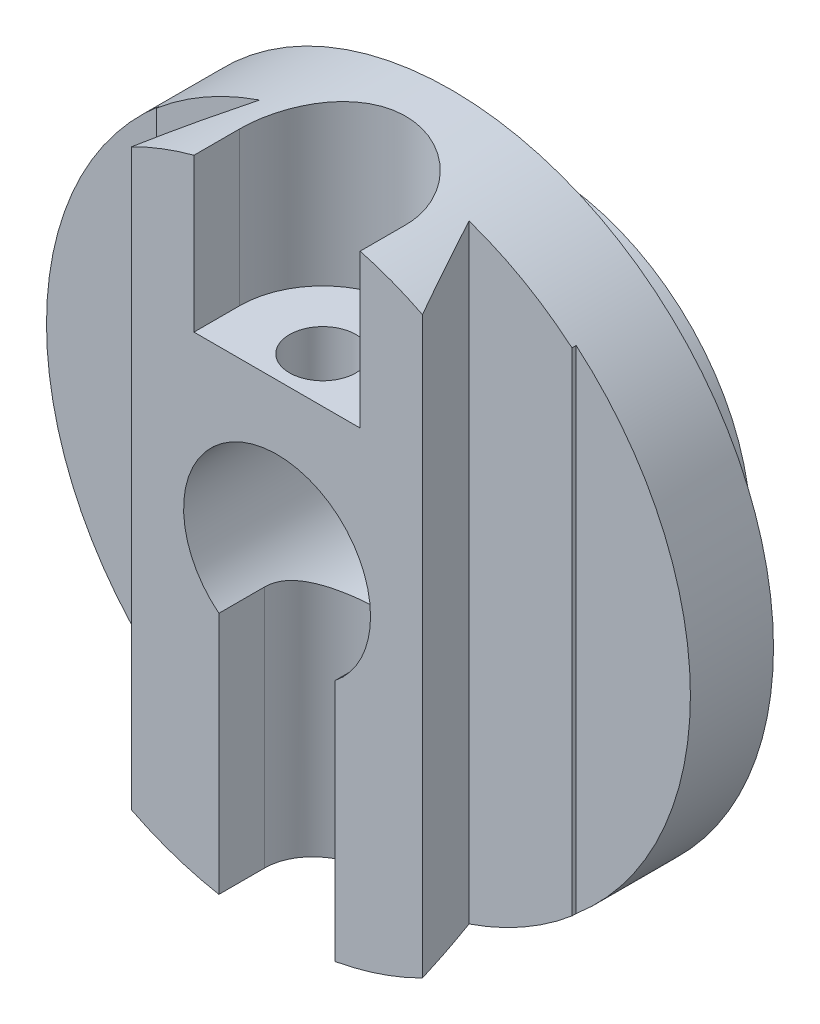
ISO-10303-21;
HEADER;
FILE_DESCRIPTION(('STEP AP214'),'2;1');
FILE_NAME('part.step','',(''),(''),'','','');
FILE_SCHEMA(('AUTOMOTIVE_DESIGN { 1 0 10303 214 1 1 1 1 }'));
ENDSEC;
DATA;
#1=APPLICATION_CONTEXT('core data for automotive mechanical design processes');
#2=APPLICATION_PROTOCOL_DEFINITION('international standard','automotive_design',2000,#1);
#3=PRODUCT_CONTEXT('',#1,'mechanical');
#4=PRODUCT('Part','Part','',(#3));
#5=PRODUCT_RELATED_PRODUCT_CATEGORY('part','',(#4));
#6=PRODUCT_DEFINITION_FORMATION('','',#4);
#7=PRODUCT_DEFINITION_CONTEXT('part definition',#1,'design');
#8=PRODUCT_DEFINITION('design','',#6,#7);
#9=PRODUCT_DEFINITION_SHAPE('','',#8);
#10=(LENGTH_UNIT() NAMED_UNIT(*) SI_UNIT(.MILLI.,.METRE.));
#11=(NAMED_UNIT(*) PLANE_ANGLE_UNIT() SI_UNIT($,.RADIAN.));
#12=(NAMED_UNIT(*) SI_UNIT($,.STERADIAN.) SOLID_ANGLE_UNIT());
#13=UNCERTAINTY_MEASURE_WITH_UNIT(LENGTH_MEASURE(1.E-05),#10,'distance_accuracy_value','');
#14=(GEOMETRIC_REPRESENTATION_CONTEXT(3) GLOBAL_UNCERTAINTY_ASSIGNED_CONTEXT((#13)) GLOBAL_UNIT_ASSIGNED_CONTEXT((#10,
#11,#12)) REPRESENTATION_CONTEXT('',''));
#15=CARTESIAN_POINT('',(0.,0.,0.));
#16=DIRECTION('',(0.,0.,1.));
#17=DIRECTION('',(1.,0.,0.));
#18=AXIS2_PLACEMENT_3D('',#15,#16,#17);
#19=CARTESIAN_POINT('',(0.,0.,64.));
#20=DIRECTION('',(0.,0.,-1.));
#21=DIRECTION('',(-1.,0.,0.));
#22=AXIS2_PLACEMENT_3D('',#19,#20,#21);
#23=CYLINDRICAL_SURFACE('',#22,77.5);
#24=CARTESIAN_POINT('',(0.,0.,22.));
#25=DIRECTION('',(0.,0.,1.));
#26=DIRECTION('',(1.,0.,0.));
#27=AXIS2_PLACEMENT_3D('',#24,#25,#26);
#28=CIRCLE('',#27,77.5);
#29=CARTESIAN_POINT('',(77.5,0.,22.));
#30=VERTEX_POINT('',#29);
#31=EDGE_CURVE('E232',#30,#30,#28,.T.);
#32=ORIENTED_EDGE('',*,*,#31,.T.);
#33=EDGE_LOOP('',(#32));
#34=FACE_BOUND('',#33,.T.);
#35=DIRECTION('',(0.,0.,-1.));
#36=VECTOR('',#35,1.);
#37=CARTESIAN_POINT('',(-14.,-76.2249959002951,64.));
#38=LINE('',#37,#36);
#39=CARTESIAN_POINT('',(-14.,-76.2249959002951,64.));
#40=VERTEX_POINT('',#39);
#41=CARTESIAN_POINT('',(-14.,-76.2249959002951,53.));
#42=VERTEX_POINT('',#41);
#43=EDGE_CURVE('E173',#40,#42,#38,.T.);
#44=ORIENTED_EDGE('',*,*,#43,.F.);
#45=CARTESIAN_POINT('',(0.,0.,64.));
#46=DIRECTION('',(0.,0.,1.));
#47=DIRECTION('',(1.,0.,0.));
#48=AXIS2_PLACEMENT_3D('',#45,#46,#47);
#49=CIRCLE('',#48,77.5);
#50=CARTESIAN_POINT('',(-35.,-69.1465834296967,64.));
#51=VERTEX_POINT('',#50);
#52=EDGE_CURVE('E226',#51,#40,#49,.T.);
#53=ORIENTED_EDGE('',*,*,#52,.F.);
#54=CARTESIAN_POINT('',(0.,0.,-11.057742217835));
#55=DIRECTION('',(0.906307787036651,0.,0.422618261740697));
#56=DIRECTION('',(0.422618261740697,0.,-0.906307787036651));
#57=AXIS2_PLACEMENT_3D('',#54,#55,#56);
#58=ELLIPSE('',#57,183.38062269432,77.5);
#59=CARTESIAN_POINT('',(-25.2075391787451,-73.2859465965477,43.));
#60=VERTEX_POINT('',#59);
#61=EDGE_CURVE('E222',#51,#60,#58,.T.);
#62=ORIENTED_EDGE('',*,*,#61,.T.);
#63=CARTESIAN_POINT('',(0.,0.,43.));
#64=DIRECTION('',(0.,0.,-1.));
#65=DIRECTION('',(-1.,0.,0.));
#66=AXIS2_PLACEMENT_3D('',#63,#64,#65);
#67=CIRCLE('',#66,77.5);
#68=CARTESIAN_POINT('',(-50.,-59.2135964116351,43.));
#69=VERTEX_POINT('',#68);
#70=EDGE_CURVE('E250',#60,#69,#67,.T.);
#71=ORIENTED_EDGE('',*,*,#70,.T.);
#72=DIRECTION('',(0.,0.,-1.));
#73=VECTOR('',#72,1.);
#74=CARTESIAN_POINT('',(-50.,-59.2135964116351,64.));
#75=LINE('',#74,#73);
#76=CARTESIAN_POINT('',(-50.,-59.2135964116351,42.));
#77=VERTEX_POINT('',#76);
#78=EDGE_CURVE('E253',#69,#77,#75,.T.);
#79=ORIENTED_EDGE('',*,*,#78,.T.);
#80=CARTESIAN_POINT('',(0.,0.,42.));
#81=DIRECTION('',(0.,0.,-1.));
#82=DIRECTION('',(-1.,0.,0.));
#83=AXIS2_PLACEMENT_3D('',#80,#81,#82);
#84=CIRCLE('',#83,77.5);
#85=CARTESIAN_POINT('',(-50.,59.2135964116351,42.));
#86=VERTEX_POINT('',#85);
#87=EDGE_CURVE('E257',#77,#86,#84,.T.);
#88=ORIENTED_EDGE('',*,*,#87,.T.);
#89=DIRECTION('',(0.,0.,-1.));
#90=VECTOR('',#89,1.);
#91=CARTESIAN_POINT('',(-50.,59.2135964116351,64.));
#92=LINE('',#91,#90);
#93=CARTESIAN_POINT('',(-50.,59.2135964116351,43.));
#94=VERTEX_POINT('',#93);
#95=EDGE_CURVE('E259',#86,#94,#92,.F.);
#96=ORIENTED_EDGE('',*,*,#95,.T.);
#97=CARTESIAN_POINT('',(-25.2075391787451,73.2859465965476,43.));
#98=VERTEX_POINT('',#97);
#99=EDGE_CURVE('E254',#94,#98,#67,.T.);
#100=ORIENTED_EDGE('',*,*,#99,.T.);
#101=CARTESIAN_POINT('',(-35.,69.1465834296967,64.));
#102=VERTEX_POINT('',#101);
#103=EDGE_CURVE('E225',#98,#102,#58,.T.);
#104=ORIENTED_EDGE('',*,*,#103,.T.);
#105=CARTESIAN_POINT('',(-20.,74.8748956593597,64.));
#106=VERTEX_POINT('',#105);
#107=EDGE_CURVE('E229',#106,#102,#49,.T.);
#108=ORIENTED_EDGE('',*,*,#107,.F.);
#109=DIRECTION('',(0.,0.,-1.));
#110=VECTOR('',#109,1.);
#111=CARTESIAN_POINT('',(-20.,74.8748956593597,64.));
#112=LINE('',#111,#110);
#113=CARTESIAN_POINT('',(-20.,74.8748956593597,53.));
#114=VERTEX_POINT('',#113);
#115=EDGE_CURVE('E183',#106,#114,#112,.T.);
#116=ORIENTED_EDGE('',*,*,#115,.T.);
#117=CARTESIAN_POINT('',(-20.,74.8748956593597,53.));
#118=CARTESIAN_POINT('',(-20.0000009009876,74.8748931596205,52.7237468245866));
#119=CARTESIAN_POINT('',(-19.9942755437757,74.8764250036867,52.4475255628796));
#120=CARTESIAN_POINT('',(-19.971394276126,74.8825321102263,51.8955991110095));
#121=CARTESIAN_POINT('',(-19.954238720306,74.8871072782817,51.6198939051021));
#122=CARTESIAN_POINT('',(-19.8856770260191,74.905355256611,50.7944200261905));
#123=CARTESIAN_POINT('',(-19.8171758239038,74.9235505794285,50.2460765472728));
#124=CARTESIAN_POINT('',(-19.6353414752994,74.9714089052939,49.1585553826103));
#125=CARTESIAN_POINT('',(-19.5221008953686,75.0010482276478,48.6193611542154));
#126=CARTESIAN_POINT('',(-19.3193923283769,75.0534200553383,47.8195767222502));
#127=CARTESIAN_POINT('',(-19.2463430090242,75.0721974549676,47.5544679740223));
#128=CARTESIAN_POINT('',(-19.0894196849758,75.1122534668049,47.027594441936));
#129=CARTESIAN_POINT('',(-19.0055430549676,75.1335326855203,46.7658304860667));
#130=CARTESIAN_POINT('',(-18.7379988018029,75.2008732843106,45.9865177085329));
#131=CARTESIAN_POINT('',(-18.5383456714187,75.2504562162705,45.4746676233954));
#132=CARTESIAN_POINT('',(-18.0979783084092,75.3575773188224,44.4698110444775));
#133=CARTESIAN_POINT('',(-17.8572630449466,75.4151156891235,43.9768050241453));
#134=CARTESIAN_POINT('',(-17.4667420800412,75.506163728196,43.2538188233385));
#135=CARTESIAN_POINT('',(-17.3316160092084,75.5373130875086,43.0155090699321));
#136=CARTESIAN_POINT('',(-17.0518157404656,75.60096671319,42.5448328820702));
#137=CARTESIAN_POINT('',(-16.9071439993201,75.6334706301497,42.3124649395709));
#138=CARTESIAN_POINT('',(-16.4590905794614,75.7327006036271,41.6246898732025));
#139=CARTESIAN_POINT('',(-16.14165249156,75.8011491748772,41.1785778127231));
#140=CARTESIAN_POINT('',(-15.4645151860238,75.9422204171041,40.3050949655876));
#141=CARTESIAN_POINT('',(-15.1040682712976,76.014900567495,39.8783147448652));
#142=CARTESIAN_POINT('',(-14.3488180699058,76.1610748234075,39.0564402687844));
#143=CARTESIAN_POINT('',(-13.9540142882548,76.2345689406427,38.6613464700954));
#144=CARTESIAN_POINT('',(-13.1325709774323,76.3803611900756,37.9053917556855));
#145=CARTESIAN_POINT('',(-12.7059264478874,76.452659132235,37.5445362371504));
#146=CARTESIAN_POINT('',(-11.8236088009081,76.5940719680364,36.8595478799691));
#147=CARTESIAN_POINT('',(-11.3679355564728,76.6631868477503,36.5354152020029));
#148=CARTESIAN_POINT('',(-10.4234962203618,76.7973408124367,35.921574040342));
#149=CARTESIAN_POINT('',(-9.93433692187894,76.8623034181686,35.6324533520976));
#150=CARTESIAN_POINT('',(-8.93248470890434,76.9851633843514,35.0965523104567));
#151=CARTESIAN_POINT('',(-8.419791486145,77.0430606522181,34.8497725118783));
#152=CARTESIAN_POINT('',(-7.37454957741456,77.1501259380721,34.4005500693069));
#153=CARTESIAN_POINT('',(-6.84200428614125,77.1992954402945,34.198099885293));
#154=CARTESIAN_POINT('',(-5.76082393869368,77.2874959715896,33.8391720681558));
#155=CARTESIAN_POINT('',(-5.21218928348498,77.32652725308,33.6826932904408));
#156=CARTESIAN_POINT('',(-4.11484145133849,77.3925945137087,33.4199205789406));
#157=CARTESIAN_POINT('',(-3.56638376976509,77.4198704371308,33.3126196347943));
#158=CARTESIAN_POINT('',(-2.46196707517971,77.4628561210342,33.1442521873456));
#159=CARTESIAN_POINT('',(-1.90600815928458,77.4785660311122,33.0831850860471));
#160=CARTESIAN_POINT('',(-0.790783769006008,77.4979719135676,33.0078270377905));
#161=CARTESIAN_POINT('',(-0.231518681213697,77.5016692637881,32.9935307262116));
#162=CARTESIAN_POINT('',(0.886188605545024,77.4969481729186,33.0118270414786));
#163=CARTESIAN_POINT('',(1.44463081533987,77.4885298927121,33.0444190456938));
#164=CARTESIAN_POINT('',(2.54334334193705,77.4601591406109,33.1548744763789));
#165=CARTESIAN_POINT('',(3.08373085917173,77.4404844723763,33.2316477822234));
#166=CARTESIAN_POINT('',(4.15593270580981,77.3903498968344,33.4289664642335));
#167=CARTESIAN_POINT('',(4.68774719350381,77.3598901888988,33.5495110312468));
#168=CARTESIAN_POINT('',(5.73915279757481,77.2890016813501,33.8333974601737));
#169=CARTESIAN_POINT('',(6.25874361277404,77.2485726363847,33.9967403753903));
#170=CARTESIAN_POINT('',(7.28220520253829,77.1588193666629,34.3649453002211));
#171=CARTESIAN_POINT('',(7.78607574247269,77.1094950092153,34.5698079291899));
#172=CARTESIAN_POINT('',(8.77948961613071,77.0027435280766,35.0216481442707));
#173=CARTESIAN_POINT('',(9.26885208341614,76.9452440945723,35.2690061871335));
#174=CARTESIAN_POINT('',(10.2250429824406,76.8240247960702,35.8026664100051));
#175=CARTESIAN_POINT('',(10.6918713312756,76.7603049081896,36.0889687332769));
#176=CARTESIAN_POINT('',(11.6001141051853,76.6283106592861,36.698572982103));
#177=CARTESIAN_POINT('',(12.0415251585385,76.5600356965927,37.0218797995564));
#178=CARTESIAN_POINT('',(12.8961303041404,76.4207256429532,37.7033166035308));
#179=CARTESIAN_POINT('',(13.3093238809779,76.3496905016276,38.0614472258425));
#180=CARTESIAN_POINT('',(14.1163696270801,76.2046652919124,38.821005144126));
#181=CARTESIAN_POINT('',(14.5093255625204,76.1306489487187,39.2233804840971));
#182=CARTESIAN_POINT('',(15.2600590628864,75.9837282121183,40.0598880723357));
#183=CARTESIAN_POINT('',(15.6178357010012,75.9108238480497,40.4940211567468));
#184=CARTESIAN_POINT('',(16.2959182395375,75.7681539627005,41.3914125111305));
#185=CARTESIAN_POINT('',(16.6162131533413,75.6983893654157,41.8546792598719));
#186=CARTESIAN_POINT('',(17.0666380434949,75.5976423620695,42.5688378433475));
#187=CARTESIAN_POINT('',(17.2117803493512,75.5647091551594,42.8101073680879));
#188=CARTESIAN_POINT('',(17.4918740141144,75.500364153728,43.2987796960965));
#189=CARTESIAN_POINT('',(17.626822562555,75.4689527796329,43.5461841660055));
#190=CARTESIAN_POINT('',(18.0174429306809,75.3770103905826,44.2998214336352));
#191=CARTESIAN_POINT('',(18.2571733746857,75.3191589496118,44.8147589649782));
#192=CARTESIAN_POINT('',(18.6922268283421,75.2123720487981,45.8639543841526));
#193=CARTESIAN_POINT('',(18.8875511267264,75.1634363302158,46.3982117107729));
#194=CARTESIAN_POINT('',(19.1459044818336,75.0978837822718,47.2107789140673));
#195=CARTESIAN_POINT('',(19.2262228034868,75.0773486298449,47.483377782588));
#196=CARTESIAN_POINT('',(19.375198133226,75.0390405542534,48.0318569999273));
#197=CARTESIAN_POINT('',(19.4438580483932,75.0212669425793,48.3077365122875));
#198=CARTESIAN_POINT('',(19.632090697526,74.9723149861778,49.1394443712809));
#199=CARTESIAN_POINT('',(19.7340166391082,74.9454798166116,49.699657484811));
#200=CARTESIAN_POINT('',(19.8745195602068,74.9083291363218,50.7167776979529));
#201=CARTESIAN_POINT('',(19.9215862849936,74.8958095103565,51.1724663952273));
#202=CARTESIAN_POINT('',(19.9843128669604,74.8790856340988,52.0854153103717));
#203=CARTESIAN_POINT('',(20.0000230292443,74.8748680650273,52.5426718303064));
#204=CARTESIAN_POINT('',(20.,74.8748956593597,53.));
#205=B_SPLINE_CURVE_WITH_KNOTS('',3,(#117,#118,#119,#120,#121,#122,#123,#124,#125,#126,#127,
#128,#129,#130,#131,#132,#133,#134,#135,#136,#137,#138,#139,#140,#141,#142,#143,#144,#145,#146,
#147,#148,#149,#150,#151,#152,#153,#154,#155,#156,#157,#158,#159,#160,#161,#162,#163,#164,#165,
#166,#167,#168,#169,#170,#171,#172,#173,#174,#175,#176,#177,#178,#179,#180,#181,#182,#183,#184,
#185,#186,#187,#188,#189,#190,#191,#192,#193,#194,#195,#196,#197,#198,#199,#200,#201,#202,#203,
#204),.UNSPECIFIED.,.F.,.F.,(4,2,2,2,2,2,2,2,2,2,2,2,2,2,2,2,2,2,2,2,2,2,2,2,2,2,2,2,2,2,2,2,2,
2,2,2,2,2,2,2,2,2,2,4),(0.,0.828632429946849,1.65723915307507,3.31380514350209,4.96696146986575,
5.79363536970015,6.62051009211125,8.27339282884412,9.9263170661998,10.7532693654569,
11.5800096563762,13.2333749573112,14.9214725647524,16.6095944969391,18.2979820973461,
19.9863770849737,21.7000407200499,23.4137268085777,25.1271211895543,26.8404729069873,
28.5169730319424,30.1934514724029,31.8697376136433,33.5460014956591,35.1825779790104,
36.8191242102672,38.4557107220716,40.0923216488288,41.7444312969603,43.3965470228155,
45.0488814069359,46.7012459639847,48.4010637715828,50.1009263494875,51.8012859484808,
52.65151265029,53.5019729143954,55.2125774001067,56.9231322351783,57.7776702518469,
58.6319948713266,60.3396514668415,61.7134133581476,63.0849695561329),.UNSPECIFIED.);
#206=CARTESIAN_POINT('',(20.,74.8748956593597,53.));
#207=VERTEX_POINT('',#206);
#208=EDGE_CURVE('E167',#114,#207,#205,.T.);
#209=ORIENTED_EDGE('',*,*,#208,.T.);
#210=DIRECTION('',(0.,0.,-1.));
#211=VECTOR('',#210,1.);
#212=CARTESIAN_POINT('',(20.,74.8748956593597,64.));
#213=LINE('',#212,#211);
#214=CARTESIAN_POINT('',(20.,74.8748956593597,64.));
#215=VERTEX_POINT('',#214);
#216=EDGE_CURVE('E189',#207,#215,#213,.F.);
#217=ORIENTED_EDGE('',*,*,#216,.T.);
#218=CARTESIAN_POINT('',(35.,69.1465834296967,64.));
#219=VERTEX_POINT('',#218);
#220=EDGE_CURVE('E231',#219,#215,#49,.T.);
#221=ORIENTED_EDGE('',*,*,#220,.F.);
#222=CARTESIAN_POINT('',(0.,0.,-11.057742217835));
#223=DIRECTION('',(0.906307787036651,0.,-0.422618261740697));
#224=DIRECTION('',(-0.422618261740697,0.,-0.906307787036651));
#225=AXIS2_PLACEMENT_3D('',#222,#223,#224);
#226=ELLIPSE('',#225,183.38062269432,77.5);
#227=CARTESIAN_POINT('',(25.2075391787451,73.2859465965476,43.));
#228=VERTEX_POINT('',#227);
#229=EDGE_CURVE('E221',#228,#219,#226,.T.);
#230=ORIENTED_EDGE('',*,*,#229,.F.);
#231=CARTESIAN_POINT('',(0.,0.,43.));
#232=DIRECTION('',(0.,0.,1.));
#233=DIRECTION('',(1.,0.,0.));
#234=AXIS2_PLACEMENT_3D('',#231,#232,#233);
#235=CIRCLE('',#234,77.5);
#236=CARTESIAN_POINT('',(50.,59.2135964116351,43.));
#237=VERTEX_POINT('',#236);
#238=EDGE_CURVE('E249',#237,#228,#235,.T.);
#239=ORIENTED_EDGE('',*,*,#238,.F.);
#240=DIRECTION('',(0.,0.,-1.));
#241=VECTOR('',#240,1.);
#242=CARTESIAN_POINT('',(50.,59.2135964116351,64.));
#243=LINE('',#242,#241);
#244=CARTESIAN_POINT('',(50.,59.2135964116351,42.));
#245=VERTEX_POINT('',#244);
#246=EDGE_CURVE('E243',#245,#237,#243,.F.);
#247=ORIENTED_EDGE('',*,*,#246,.F.);
#248=CARTESIAN_POINT('',(0.,0.,42.));
#249=DIRECTION('',(0.,0.,1.));
#250=DIRECTION('',(1.,0.,0.));
#251=AXIS2_PLACEMENT_3D('',#248,#249,#250);
#252=CIRCLE('',#251,77.5);
#253=CARTESIAN_POINT('',(50.,-59.2135964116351,42.));
#254=VERTEX_POINT('',#253);
#255=EDGE_CURVE('E241',#254,#245,#252,.T.);
#256=ORIENTED_EDGE('',*,*,#255,.F.);
#257=DIRECTION('',(0.,0.,-1.));
#258=VECTOR('',#257,1.);
#259=CARTESIAN_POINT('',(50.,-59.2135964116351,64.));
#260=LINE('',#259,#258);
#261=CARTESIAN_POINT('',(50.,-59.2135964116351,43.));
#262=VERTEX_POINT('',#261);
#263=EDGE_CURVE('E245',#262,#254,#260,.T.);
#264=ORIENTED_EDGE('',*,*,#263,.F.);
#265=CARTESIAN_POINT('',(25.2075391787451,-73.2859465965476,43.));
#266=VERTEX_POINT('',#265);
#267=EDGE_CURVE('E247',#266,#262,#235,.T.);
#268=ORIENTED_EDGE('',*,*,#267,.F.);
#269=CARTESIAN_POINT('',(35.,-69.1465834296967,64.));
#270=VERTEX_POINT('',#269);
#271=EDGE_CURVE('E205',#270,#266,#226,.T.);
#272=ORIENTED_EDGE('',*,*,#271,.F.);
#273=CARTESIAN_POINT('',(14.,-76.2249959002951,64.));
#274=VERTEX_POINT('',#273);
#275=EDGE_CURVE('E230',#274,#270,#49,.T.);
#276=ORIENTED_EDGE('',*,*,#275,.F.);
#277=DIRECTION('',(0.,0.,-1.));
#278=VECTOR('',#277,1.);
#279=CARTESIAN_POINT('',(14.,-76.2249959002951,64.));
#280=LINE('',#279,#278);
#281=CARTESIAN_POINT('',(14.,-76.2249959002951,53.));
#282=VERTEX_POINT('',#281);
#283=EDGE_CURVE('E322',#282,#274,#280,.F.);
#284=ORIENTED_EDGE('',*,*,#283,.F.);
#285=CARTESIAN_POINT('',(-14.,-76.2249959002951,53.));
#286=CARTESIAN_POINT('',(-14.000045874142,-76.2249646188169,52.6096710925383));
#287=CARTESIAN_POINT('',(-13.9836780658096,-76.2279930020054,52.2193531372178));
#288=CARTESIAN_POINT('',(-13.9184497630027,-76.2399421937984,51.4415738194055));
#289=CARTESIAN_POINT('',(-13.8695928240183,-76.2488623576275,51.0541121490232));
#290=CARTESIAN_POINT('',(-13.7398097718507,-76.2723521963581,50.2853204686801));
#291=CARTESIAN_POINT('',(-13.6589276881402,-76.2869141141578,49.9039827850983));
#292=CARTESIAN_POINT('',(-13.4657335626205,-76.3212532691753,49.1495971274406));
#293=CARTESIAN_POINT('',(-13.3534214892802,-76.3410305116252,48.7765491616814));
#294=CARTESIAN_POINT('',(-13.0981949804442,-76.3852343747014,48.0412949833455));
#295=CARTESIAN_POINT('',(-12.9552757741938,-76.4096617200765,47.6790904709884));
#296=CARTESIAN_POINT('',(-12.6399020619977,-76.4624641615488,46.9680741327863));
#297=CARTESIAN_POINT('',(-12.4674471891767,-76.4908393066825,46.6192624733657));
#298=CARTESIAN_POINT('',(-12.094240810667,-76.5507350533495,45.9373940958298));
#299=CARTESIAN_POINT('',(-11.8934885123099,-76.5822557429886,45.604337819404));
#300=CARTESIAN_POINT('',(-11.4651019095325,-76.6475594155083,44.9562239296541));
#301=CARTESIAN_POINT('',(-11.2374674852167,-76.6813424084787,44.6411663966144));
#302=CARTESIAN_POINT('',(-10.754416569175,-76.7505872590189,44.0280214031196));
#303=CARTESIAN_POINT('',(-10.4987393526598,-76.786062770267,43.7301408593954));
#304=CARTESIAN_POINT('',(-9.96330605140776,-76.8573708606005,43.1569133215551));
#305=CARTESIAN_POINT('',(-9.68354977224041,-76.8932034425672,42.8815665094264));
#306=CARTESIAN_POINT('',(-9.10182172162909,-76.9642299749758,42.3552492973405));
#307=CARTESIAN_POINT('',(-8.79984657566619,-76.9994238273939,42.1042826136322));
#308=CARTESIAN_POINT('',(-8.17576974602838,-77.0681861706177,41.6285116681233));
#309=CARTESIAN_POINT('',(-7.85366803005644,-77.1017546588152,41.4037074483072));
#310=CARTESIAN_POINT('',(-7.18919345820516,-77.1665581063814,40.9803588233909));
#311=CARTESIAN_POINT('',(-6.84669362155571,-77.1977749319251,40.782010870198));
#312=CARTESIAN_POINT('',(-6.14589181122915,-77.256725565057,40.4149102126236));
#313=CARTESIAN_POINT('',(-5.7875897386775,-77.2844593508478,40.2461576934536));
#314=CARTESIAN_POINT('',(-5.05775660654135,-77.3356507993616,39.9395349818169));
#315=CARTESIAN_POINT('',(-4.68622707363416,-77.3591089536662,39.801661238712));
#316=CARTESIAN_POINT('',(-3.93256507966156,-77.4010810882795,39.5578353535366));
#317=CARTESIAN_POINT('',(-3.550432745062,-77.4195951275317,39.4518828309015));
#318=CARTESIAN_POINT('',(-2.78251054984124,-77.4509761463,39.2736997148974));
#319=CARTESIAN_POINT('',(-2.39680463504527,-77.4639018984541,39.2011176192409));
#320=CARTESIAN_POINT('',(-1.62051425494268,-77.4840285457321,39.0885747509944));
#321=CARTESIAN_POINT('',(-1.22992982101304,-77.4912294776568,39.0486137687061));
#322=CARTESIAN_POINT('',(-0.446738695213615,-77.4997018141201,39.0016316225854));
#323=CARTESIAN_POINT('',(-0.0541320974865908,-77.500973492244,38.9946089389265));
#324=CARTESIAN_POINT('',(0.730256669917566,-77.4975518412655,39.0135555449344));
#325=CARTESIAN_POINT('',(1.12203884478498,-77.4928585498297,39.0395246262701));
#326=CARTESIAN_POINT('',(1.89737648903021,-77.4777294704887,39.1237522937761));
#327=CARTESIAN_POINT('',(2.2809746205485,-77.4673612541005,39.1816309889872));
#328=CARTESIAN_POINT('',(3.04186597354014,-77.4412161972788,39.3289643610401));
#329=CARTESIAN_POINT('',(3.41915925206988,-77.4254394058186,39.4184187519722));
#330=CARTESIAN_POINT('',(4.16481126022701,-77.3889119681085,39.6282254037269));
#331=CARTESIAN_POINT('',(4.53316984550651,-77.3681612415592,39.7485781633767));
#332=CARTESIAN_POINT('',(5.25840864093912,-77.3222553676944,40.019285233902));
#333=CARTESIAN_POINT('',(5.61528875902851,-77.2971001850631,40.1696397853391));
#334=CARTESIAN_POINT('',(6.31699775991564,-77.2429287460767,40.500130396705));
#335=CARTESIAN_POINT('',(6.66175282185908,-77.213892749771,40.6804199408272));
#336=CARTESIAN_POINT('',(7.33487492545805,-77.1528601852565,41.0689220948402));
#337=CARTESIAN_POINT('',(7.66324192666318,-77.1208636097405,41.2771347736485));
#338=CARTESIAN_POINT('',(8.30140321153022,-77.0547833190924,41.7200370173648));
#339=CARTESIAN_POINT('',(8.61119665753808,-77.0206995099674,41.9547277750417));
#340=CARTESIAN_POINT('',(9.21013354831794,-76.9513764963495,42.4489718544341));
#341=CARTESIAN_POINT('',(9.49927682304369,-76.9161372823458,42.7085253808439));
#342=CARTESIAN_POINT('',(10.0589170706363,-76.8449666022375,43.2545816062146));
#343=CARTESIAN_POINT('',(10.3290927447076,-76.8090323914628,43.5414133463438));
#344=CARTESIAN_POINT('',(10.8443634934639,-76.737979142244,44.1368850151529));
#345=CARTESIAN_POINT('',(11.0894581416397,-76.7028601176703,44.445525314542));
#346=CARTESIAN_POINT('',(11.552917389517,-76.6344244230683,45.0825946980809));
#347=CARTESIAN_POINT('',(11.7712740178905,-76.6011082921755,45.4110296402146));
#348=CARTESIAN_POINT('',(12.1796054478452,-76.5372454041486,46.0853372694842));
#349=CARTESIAN_POINT('',(12.3695811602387,-76.5066985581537,46.4312093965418));
#350=CARTESIAN_POINT('',(12.7201354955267,-76.4491974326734,47.1387415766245));
#351=CARTESIAN_POINT('',(12.8806517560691,-76.4222508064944,47.500433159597));
#352=CARTESIAN_POINT('',(13.1705816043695,-76.3728186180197,48.2363684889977));
#353=CARTESIAN_POINT('',(13.2999957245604,-76.3503329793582,48.6106120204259));
#354=CARTESIAN_POINT('',(13.526581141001,-76.3105158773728,49.3684919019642));
#355=CARTESIAN_POINT('',(13.623792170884,-76.2931780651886,49.7521160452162));
#356=CARTESIAN_POINT('',(13.7853872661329,-76.2641452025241,50.5262685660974));
#357=CARTESIAN_POINT('',(13.849787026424,-76.2524474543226,50.9167935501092));
#358=CARTESIAN_POINT('',(13.9316803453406,-76.2375202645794,51.5899600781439));
#359=CARTESIAN_POINT('',(13.957313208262,-76.2328271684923,51.8716065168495));
#360=CARTESIAN_POINT('',(13.9914629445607,-76.2265638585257,52.4354931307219));
#361=CARTESIAN_POINT('',(14.0000085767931,-76.2249883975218,52.7177315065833));
#362=CARTESIAN_POINT('',(14.,-76.2249959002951,53.));
#363=B_SPLINE_CURVE_WITH_KNOTS('',3,(#285,#286,#287,#288,#289,#290,#291,#292,#293,#294,#295,
#296,#297,#298,#299,#300,#301,#302,#303,#304,#305,#306,#307,#308,#309,#310,#311,#312,#313,#314,
#315,#316,#317,#318,#319,#320,#321,#322,#323,#324,#325,#326,#327,#328,#329,#330,#331,#332,#333,
#334,#335,#336,#337,#338,#339,#340,#341,#342,#343,#344,#345,#346,#347,#348,#349,#350,#351,#352,
#353,#354,#355,#356,#357,#358,#359,#360,#361,#362),.UNSPECIFIED.,.F.,.F.,(4,2,2,2,2,2,2,2,2,2,2,
2,2,2,2,2,2,2,2,2,2,2,2,2,2,2,2,2,2,2,2,2,2,2,2,2,2,2,4),(0.,1.17061558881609,2.34110309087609,
3.50998691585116,4.67887191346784,5.84793923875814,7.0170210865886,8.18613568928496,
9.35525550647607,10.5363524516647,11.7174589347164,12.8987451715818,14.0800333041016,
15.2696554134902,16.4592849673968,17.6487776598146,18.8382561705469,20.0149010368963,
21.1915383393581,22.3681213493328,23.5446969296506,24.7075584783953,25.8704094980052,
27.0332792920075,28.1961584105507,29.3651952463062,30.534234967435,31.7033273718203,
32.8724294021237,34.0580550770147,35.2437009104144,36.4296993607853,37.6156597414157,
38.8041024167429,39.9925247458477,41.1794752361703,42.3658574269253,43.2138985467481,
44.0605111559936),.UNSPECIFIED.);
#364=EDGE_CURVE('E316',#42,#282,#363,.T.);
#365=ORIENTED_EDGE('',*,*,#364,.F.);
#366=EDGE_LOOP('',(#44,#53,#62,#71,#79,#88,#96,#100,#104,#108,#116,#209,#217,#221,#230,#239,
#247,#256,#264,#268,#272,#276,#284,#365));
#367=FACE_BOUND('',#366,.T.);
#368=ADVANCED_FACE('F45',(#34,#367),#23,.T.);
#369=CARTESIAN_POINT('',(0.,0.,64.));
#370=DIRECTION('',(0.,0.,1.));
#371=DIRECTION('',(1.,0.,0.));
#372=AXIS2_PLACEMENT_3D('',#369,#370,#371);
#373=PLANE('',#372);
#374=ORIENTED_EDGE('',*,*,#52,.T.);
#375=DIRECTION('',(0.,-1.,0.));
#376=VECTOR('',#375,1.);
#377=CARTESIAN_POINT('',(-14.,0.,64.));
#378=LINE('',#377,#376);
#379=CARTESIAN_POINT('',(-14.,-17.6139149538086,64.));
#380=VERTEX_POINT('',#379);
#381=EDGE_CURVE('E323',#380,#40,#378,.T.);
#382=ORIENTED_EDGE('',*,*,#381,.F.);
#383=CARTESIAN_POINT('',(0.,0.,64.));
#384=DIRECTION('',(0.,0.,1.));
#385=DIRECTION('',(1.,0.,0.));
#386=AXIS2_PLACEMENT_3D('',#383,#384,#385);
#387=CIRCLE('',#386,22.5);
#388=CARTESIAN_POINT('',(14.,-17.6139149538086,64.));
#389=VERTEX_POINT('',#388);
#390=EDGE_CURVE('E179',#389,#380,#387,.T.);
#391=ORIENTED_EDGE('',*,*,#390,.F.);
#392=DIRECTION('',(0.,-1.,0.));
#393=VECTOR('',#392,1.);
#394=CARTESIAN_POINT('',(14.,0.,64.));
#395=LINE('',#394,#393);
#396=EDGE_CURVE('E365',#389,#274,#395,.T.);
#397=ORIENTED_EDGE('',*,*,#396,.T.);
#398=ORIENTED_EDGE('',*,*,#275,.T.);
#399=DIRECTION('',(0.,1.,0.));
#400=VECTOR('',#399,1.);
#401=CARTESIAN_POINT('',(35.,0.,64.));
#402=LINE('',#401,#400);
#403=EDGE_CURVE('E235',#270,#219,#402,.T.);
#404=ORIENTED_EDGE('',*,*,#403,.T.);
#405=ORIENTED_EDGE('',*,*,#220,.T.);
#406=DIRECTION('',(0.,1.,0.));
#407=VECTOR('',#406,1.);
#408=CARTESIAN_POINT('',(20.,38.,64.));
#409=LINE('',#408,#407);
#410=CARTESIAN_POINT('',(20.,38.,64.));
#411=VERTEX_POINT('',#410);
#412=EDGE_CURVE('E342',#411,#215,#409,.T.);
#413=ORIENTED_EDGE('',*,*,#412,.F.);
#414=DIRECTION('',(1.,0.,0.));
#415=VECTOR('',#414,1.);
#416=CARTESIAN_POINT('',(-20.,38.,64.));
#417=LINE('',#416,#415);
#418=CARTESIAN_POINT('',(-20.,38.,64.));
#419=VERTEX_POINT('',#418);
#420=EDGE_CURVE('E328',#419,#411,#417,.T.);
#421=ORIENTED_EDGE('',*,*,#420,.F.);
#422=DIRECTION('',(0.,1.,0.));
#423=VECTOR('',#422,1.);
#424=CARTESIAN_POINT('',(-20.,38.,64.));
#425=LINE('',#424,#423);
#426=EDGE_CURVE('E335',#419,#106,#425,.T.);
#427=ORIENTED_EDGE('',*,*,#426,.T.);
#428=ORIENTED_EDGE('',*,*,#107,.T.);
#429=DIRECTION('',(0.,1.,0.));
#430=VECTOR('',#429,1.);
#431=CARTESIAN_POINT('',(-35.,0.,64.));
#432=LINE('',#431,#430);
#433=EDGE_CURVE('E238',#51,#102,#432,.T.);
#434=ORIENTED_EDGE('',*,*,#433,.F.);
#435=EDGE_LOOP('',(#374,#382,#391,#397,#398,#404,#405,#413,#421,#427,#428,#434));
#436=FACE_BOUND('',#435,.T.);
#437=ADVANCED_FACE('F296',(#436),#373,.T.);
#438=CARTESIAN_POINT('',(0.,0.,64.));
#439=DIRECTION('',(0.,0.,1.));
#440=DIRECTION('',(1.,0.,0.));
#441=AXIS2_PLACEMENT_3D('',#438,#439,#440);
#442=CYLINDRICAL_SURFACE('',#441,22.5);
#443=CARTESIAN_POINT('',(0.,22.5,61.));
#444=CARTESIAN_POINT('',(0.217395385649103,22.5000003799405,61.0000005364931));
#445=CARTESIAN_POINT('',(0.434782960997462,22.4968422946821,60.9911316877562));
#446=CARTESIAN_POINT('',(0.867937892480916,22.4842972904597,60.9557463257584));
#447=CARTESIAN_POINT('',(1.08370524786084,22.4749103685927,60.9292298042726));
#448=CARTESIAN_POINT('',(1.51201573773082,22.4501631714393,60.8588110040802));
#449=CARTESIAN_POINT('',(1.72455908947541,22.4348033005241,60.8149099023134));
#450=CARTESIAN_POINT('',(2.14493342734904,22.3985216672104,60.7101352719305));
#451=CARTESIAN_POINT('',(2.35276433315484,22.3775998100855,60.6492614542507));
#452=CARTESIAN_POINT('',(2.76188512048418,22.3307927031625,60.5112253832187));
#453=CARTESIAN_POINT('',(2.96318744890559,22.3049176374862,60.4340965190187));
#454=CARTESIAN_POINT('',(3.3584766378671,22.2488315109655,60.2640857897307));
#455=CARTESIAN_POINT('',(3.55246092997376,22.2186189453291,60.1711984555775));
#456=CARTESIAN_POINT('',(3.93183827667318,22.1546304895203,59.9704162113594));
#457=CARTESIAN_POINT('',(4.11723272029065,22.1208551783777,59.862523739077));
#458=CARTESIAN_POINT('',(4.47846415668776,22.0505608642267,59.632438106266));
#459=CARTESIAN_POINT('',(4.65429767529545,22.0140408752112,59.510239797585));
#460=CARTESIAN_POINT('',(5.00129935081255,21.937858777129,59.2478753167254));
#461=CARTESIAN_POINT('',(5.17209264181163,21.8981315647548,59.1072320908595));
#462=CARTESIAN_POINT('',(5.50133556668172,21.8177457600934,58.8124126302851));
#463=CARTESIAN_POINT('',(5.65978488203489,21.7770871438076,58.6582360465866));
#464=CARTESIAN_POINT('',(5.96346911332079,21.6958925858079,58.3372160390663));
#465=CARTESIAN_POINT('',(6.10869841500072,21.6553567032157,58.1703672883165));
#466=CARTESIAN_POINT('',(6.38492763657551,21.5755270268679,57.8250970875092));
#467=CARTESIAN_POINT('',(6.51593238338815,21.5362328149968,57.6466795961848));
#468=CARTESIAN_POINT('',(6.76711461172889,21.4586585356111,57.2730019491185));
#469=CARTESIAN_POINT('',(6.88677253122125,21.420458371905,57.0773753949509));
#470=CARTESIAN_POINT('',(7.10905734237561,21.3477160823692,56.6761235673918));
#471=CARTESIAN_POINT('',(7.21169101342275,21.3131725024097,56.4705023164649));
#472=CARTESIAN_POINT('',(7.39911280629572,21.2488341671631,56.0505721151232));
#473=CARTESIAN_POINT('',(7.48390205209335,21.2190391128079,55.8362637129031));
#474=CARTESIAN_POINT('',(7.63484505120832,21.1651971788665,55.4004801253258));
#475=CARTESIAN_POINT('',(7.70099977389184,21.1411500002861,55.179005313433));
#476=CARTESIAN_POINT('',(7.81187412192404,21.1004260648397,54.7390067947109));
#477=CARTESIAN_POINT('',(7.85730590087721,21.0835062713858,54.5206850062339));
#478=CARTESIAN_POINT('',(7.92981882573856,21.0563405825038,54.0806017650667));
#479=CARTESIAN_POINT('',(7.95690040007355,21.0460945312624,53.8588403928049));
#480=CARTESIAN_POINT('',(7.9924155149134,21.0326331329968,53.4136853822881));
#481=CARTESIAN_POINT('',(8.00085486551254,21.0294155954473,53.1902922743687));
#482=CARTESIAN_POINT('',(7.99900855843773,21.0301180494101,52.7435986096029));
#483=CARTESIAN_POINT('',(7.98872352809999,21.0340378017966,52.5202980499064));
#484=CARTESIAN_POINT('',(7.95058888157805,21.0484802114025,52.0874160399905));
#485=CARTESIAN_POINT('',(7.92370279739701,21.0586405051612,51.8777367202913));
#486=CARTESIAN_POINT('',(7.85349861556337,21.084922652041,51.4614522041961));
#487=CARTESIAN_POINT('',(7.81017475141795,21.1010465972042,51.2548481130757));
#488=CARTESIAN_POINT('',(7.70750784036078,21.1387631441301,50.8462383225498));
#489=CARTESIAN_POINT('',(7.64816924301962,21.1603542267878,50.6442313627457));
#490=CARTESIAN_POINT('',(7.51395074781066,21.2083856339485,50.2459626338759));
#491=CARTESIAN_POINT('',(7.43906492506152,21.2348278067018,50.0497030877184));
#492=CARTESIAN_POINT('',(7.27293329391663,21.2923060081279,49.6608516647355));
#493=CARTESIAN_POINT('',(7.18142751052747,21.3234134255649,49.4683814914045));
#494=CARTESIAN_POINT('',(6.98360505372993,21.3890186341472,49.0917359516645));
#495=CARTESIAN_POINT('',(6.87728333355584,21.4235175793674,48.9075634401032));
#496=CARTESIAN_POINT('',(6.65056051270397,21.4949800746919,48.5485825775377));
#497=CARTESIAN_POINT('',(6.5301581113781,21.5319438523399,48.3737750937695));
#498=CARTESIAN_POINT('',(6.27602595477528,21.607384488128,48.0344758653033));
#499=CARTESIAN_POINT('',(6.14229566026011,21.6458614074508,47.8699845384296));
#500=CARTESIAN_POINT('',(5.85384927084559,21.7257028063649,47.542632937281));
#501=CARTESIAN_POINT('',(5.69835464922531,21.7671017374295,47.3804662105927));
#502=CARTESIAN_POINT('',(5.37426417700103,21.8493757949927,47.0697670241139));
#503=CARTESIAN_POINT('',(5.20567239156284,21.8902510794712,46.9212303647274));
#504=CARTESIAN_POINT('',(4.85626844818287,21.9704072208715,46.6386190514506));
#505=CARTESIAN_POINT('',(4.6754501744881,22.0096872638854,46.5045517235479));
#506=CARTESIAN_POINT('',(4.30284121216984,22.08555379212,46.2519485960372));
#507=CARTESIAN_POINT('',(4.11105492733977,22.1221413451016,46.133406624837));
#508=CARTESIAN_POINT('',(3.71505636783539,22.1921000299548,45.9112363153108));
#509=CARTESIAN_POINT('',(3.51071396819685,22.2254226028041,45.8078243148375));
#510=CARTESIAN_POINT('',(3.09339691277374,22.2873364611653,45.618716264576));
#511=CARTESIAN_POINT('',(2.8804259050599,22.3159297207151,45.5330128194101));
#512=CARTESIAN_POINT('',(2.44731989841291,22.367569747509,45.3800681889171));
#513=CARTESIAN_POINT('',(2.2271856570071,22.3906170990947,45.3128250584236));
#514=CARTESIAN_POINT('',(1.78141160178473,22.4304844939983,45.1974639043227));
#515=CARTESIAN_POINT('',(1.5557720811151,22.4473048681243,45.149344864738));
#516=CARTESIAN_POINT('',(1.1118418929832,22.4735584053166,45.0745985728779));
#517=CARTESIAN_POINT('',(0.893726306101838,22.4833105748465,45.0470413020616));
#518=CARTESIAN_POINT('',(0.455778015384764,22.4964497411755,45.0099715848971));
#519=CARTESIAN_POINT('',(0.235945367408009,22.4998369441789,45.0004585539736));
#520=CARTESIAN_POINT('',(-0.203721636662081,22.500151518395,44.9995738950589));
#521=CARTESIAN_POINT('',(-0.423555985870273,22.4970800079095,45.0081991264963));
#522=CARTESIAN_POINT('',(-0.861585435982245,22.4845652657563,45.0434965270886));
#523=CARTESIAN_POINT('',(-1.0797805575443,22.4751221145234,45.0701684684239));
#524=CARTESIAN_POINT('',(-1.5055119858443,22.4505533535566,45.1400779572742));
#525=CARTESIAN_POINT('',(-1.71315823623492,22.4356321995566,45.1827204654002));
#526=CARTESIAN_POINT('',(-2.12406217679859,22.4004664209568,45.2842264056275));
#527=CARTESIAN_POINT('',(-2.32731828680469,22.380219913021,45.343095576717));
#528=CARTESIAN_POINT('',(-2.72799070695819,22.3349212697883,45.4765272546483));
#529=CARTESIAN_POINT('',(-2.92540864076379,22.3098704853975,45.5510853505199));
#530=CARTESIAN_POINT('',(-3.31332553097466,22.2555667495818,45.7153408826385));
#531=CARTESIAN_POINT('',(-3.50382183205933,22.2263122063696,45.8050440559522));
#532=CARTESIAN_POINT('',(-3.88188328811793,22.1634544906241,46.001598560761));
#533=CARTESIAN_POINT('',(-4.06922079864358,22.1297532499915,46.1088563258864));
#534=CARTESIAN_POINT('',(-4.43430472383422,22.0594994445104,46.3379132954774));
#535=CARTESIAN_POINT('',(-4.61204780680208,22.0229458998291,46.4597175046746));
#536=CARTESIAN_POINT('',(-4.95689983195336,21.9478994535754,46.7170519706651));
#537=CARTESIAN_POINT('',(-5.12400744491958,21.9094063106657,46.8525839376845));
#538=CARTESIAN_POINT('',(-5.44664610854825,21.8314359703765,47.1365341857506));
#539=CARTESIAN_POINT('',(-5.60217679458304,21.7919587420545,47.2849528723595));
#540=CARTESIAN_POINT('',(-5.90860260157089,21.7109379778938,47.6018980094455));
#541=CARTESIAN_POINT('',(-6.05883089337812,21.669394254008,47.7710699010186));
#542=CARTESIAN_POINT('',(-6.34450156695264,21.5874820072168,48.1216384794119));
#543=CARTESIAN_POINT('',(-6.4799487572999,21.5471131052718,48.303031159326));
#544=CARTESIAN_POINT('',(-6.73525343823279,21.4686797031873,48.6770779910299));
#545=CARTESIAN_POINT('',(-6.85510377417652,21.4306162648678,48.8697372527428));
#546=CARTESIAN_POINT('',(-7.07820376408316,21.3579679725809,49.264962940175));
#547=CARTESIAN_POINT('',(-7.18146037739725,21.3233816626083,49.4675251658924));
#548=CARTESIAN_POINT('',(-7.37071112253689,21.2587073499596,49.8815873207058));
#549=CARTESIAN_POINT('',(-7.45668251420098,21.2286252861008,50.0930985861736));
#550=CARTESIAN_POINT('',(-7.6103793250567,21.1740119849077,50.523255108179));
#551=CARTESIAN_POINT('',(-7.67811226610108,21.1494784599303,50.7418973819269));
#552=CARTESIAN_POINT('',(-7.7946886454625,21.1067924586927,51.1847217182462));
#553=CARTESIAN_POINT('',(-7.84353659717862,21.088638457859,51.4089024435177));
#554=CARTESIAN_POINT('',(-7.92183618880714,21.0593510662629,51.8610754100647));
#555=CARTESIAN_POINT('',(-7.9512889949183,21.0482172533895,52.0890674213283));
#556=CARTESIAN_POINT('',(-7.98932702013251,21.0338069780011,52.5336384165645));
#557=CARTESIAN_POINT('',(-7.99902729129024,21.0301108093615,52.7501090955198));
#558=CARTESIAN_POINT('',(-8.00083343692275,21.029423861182,53.1831325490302));
#559=CARTESIAN_POINT('',(-7.9929397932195,21.0324328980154,53.3996853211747));
#560=CARTESIAN_POINT('',(-7.95964187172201,21.0450567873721,53.8312241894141));
#561=CARTESIAN_POINT('',(-7.93423904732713,21.0546710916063,54.0462104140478));
#562=CARTESIAN_POINT('',(-7.8661823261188,21.080191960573,54.4730522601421));
#563=CARTESIAN_POINT('',(-7.82352840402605,21.0960985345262,54.6849078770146));
#564=CARTESIAN_POINT('',(-7.72265491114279,21.1332299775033,55.0987692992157));
#565=CARTESIAN_POINT('',(-7.66484911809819,21.1543126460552,55.3008890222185));
#566=CARTESIAN_POINT('',(-7.53370531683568,21.2013710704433,55.6995052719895));
#567=CARTESIAN_POINT('',(-7.46036216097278,21.227348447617,55.8959999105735));
#568=CARTESIAN_POINT('',(-7.29874022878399,21.2834607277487,56.2820982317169));
#569=CARTESIAN_POINT('',(-7.21046400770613,21.3135949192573,56.4717030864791));
#570=CARTESIAN_POINT('',(-7.0196048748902,21.3772136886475,56.8430176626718));
#571=CARTESIAN_POINT('',(-6.91701642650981,21.4106995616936,57.0247242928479));
#572=CARTESIAN_POINT('',(-6.57826571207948,21.5182324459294,57.5734840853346));
#573=CARTESIAN_POINT('',(-6.31882314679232,21.596551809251,57.9256747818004));
#574=CARTESIAN_POINT('',(-5.74641063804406,21.7558429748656,58.5828995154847));
#575=CARTESIAN_POINT('',(-5.43342458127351,21.8368155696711,58.8879193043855));
#576=CARTESIAN_POINT('',(-4.92167558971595,21.955861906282,59.3110468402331));
#577=CARTESIAN_POINT('',(-4.73947865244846,21.9960051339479,59.4490026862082));
#578=CARTESIAN_POINT('',(-4.36359365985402,22.0736451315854,59.7090395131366));
#579=CARTESIAN_POINT('',(-4.16990997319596,22.1111428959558,59.8311264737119));
#580=CARTESIAN_POINT('',(-3.77220371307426,22.1824551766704,60.0585398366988));
#581=CARTESIAN_POINT('',(-3.56817733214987,22.2162683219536,60.1638600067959));
#582=CARTESIAN_POINT('',(-3.15130946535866,22.2792201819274,60.3567631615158));
#583=CARTESIAN_POINT('',(-2.93847186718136,22.3083609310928,60.4443538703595));
#584=CARTESIAN_POINT('',(-2.50518729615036,22.3611653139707,60.6011296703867));
#585=CARTESIAN_POINT('',(-2.28473221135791,22.3848228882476,60.6702944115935));
#586=CARTESIAN_POINT('',(-1.83811155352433,22.4259142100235,60.7894002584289));
#587=CARTESIAN_POINT('',(-1.61194593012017,22.4433479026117,60.8393411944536));
#588=CARTESIAN_POINT('',(-1.15579658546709,22.4714559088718,60.9194532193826));
#589=CARTESIAN_POINT('',(-0.925814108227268,22.4821323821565,60.9496306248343));
#590=CARTESIAN_POINT('',(-0.463884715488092,22.496404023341,60.9899031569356));
#591=CARTESIAN_POINT('',(-0.231937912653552,22.4999995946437,60.9999994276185));
#592=CARTESIAN_POINT('',(0.,22.5,61.));
#593=B_SPLINE_CURVE_WITH_KNOTS('',3,(#443,#444,#445,#446,#447,#448,#449,#450,#451,#452,#453,
#454,#455,#456,#457,#458,#459,#460,#461,#462,#463,#464,#465,#466,#467,#468,#469,#470,#471,#472,
#473,#474,#475,#476,#477,#478,#479,#480,#481,#482,#483,#484,#485,#486,#487,#488,#489,#490,#491,
#492,#493,#494,#495,#496,#497,#498,#499,#500,#501,#502,#503,#504,#505,#506,#507,#508,#509,#510,
#511,#512,#513,#514,#515,#516,#517,#518,#519,#520,#521,#522,#523,#524,#525,#526,#527,#528,#529,
#530,#531,#532,#533,#534,#535,#536,#537,#538,#539,#540,#541,#542,#543,#544,#545,#546,#547,#548,
#549,#550,#551,#552,#553,#554,#555,#556,#557,#558,#559,#560,#561,#562,#563,#564,#565,#566,#567,
#568,#569,#570,#571,#572,#573,#574,#575,#576,#577,#578,#579,#580,#581,#582,#583,#584,#585,#586,
#587,#588,#589,#590,#591,#592),.UNSPECIFIED.,.T.,.F.,(4,2,2,2,2,2,2,2,2,2,2,2,2,2,2,2,2,2,2,2,2,
2,2,2,2,2,2,2,2,2,2,2,2,2,2,2,2,2,2,2,2,2,2,2,2,2,2,2,2,2,2,2,2,2,2,2,2,2,2,2,2,2,2,2,2,2,2,2,2,
2,2,2,2,2,4),(0.,0.65196990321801,1.30394011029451,1.95586618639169,2.60780336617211,
3.25841424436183,3.90925138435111,4.5599829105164,5.21094933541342,5.88455282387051,
6.55817368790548,7.23207930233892,7.90575551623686,8.60233650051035,9.2986394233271,
9.99489847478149,10.6911213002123,11.3611779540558,12.0312189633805,12.7010511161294,
13.3708608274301,14.0050371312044,14.6394361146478,15.2736590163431,15.908124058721,
16.5535358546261,17.1991680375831,17.8448599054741,18.4905779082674,19.1751450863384,
19.8595006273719,20.5442010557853,21.2286284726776,21.9220456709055,22.6151726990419,
23.3082266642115,24.0012438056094,24.6606143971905,25.319963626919,25.9791987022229,
26.6384254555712,27.2752034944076,27.9122070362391,28.5490317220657,29.1860981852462,
29.8408248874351,30.4957775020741,31.1508118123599,31.8058667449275,32.4951486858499,
33.1842057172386,33.8735777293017,34.5626598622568,35.2526426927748,35.9423405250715,
36.6318734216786,37.3213648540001,37.9707151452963,38.6200476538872,39.2693262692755,
39.9186058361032,40.5517276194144,41.1850594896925,41.8182830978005,42.4517523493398,
43.7787098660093,45.1060674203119,45.8014505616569,46.4965709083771,47.1919490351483,
47.8870235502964,48.5828625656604,49.2787077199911,49.9743303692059,50.6699133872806),.UNSPECIFIED.);
#594=CARTESIAN_POINT('',(0.,22.5,61.));
#595=VERTEX_POINT('',#594);
#596=EDGE_CURVE('E174',#595,#595,#593,.T.);
#597=ORIENTED_EDGE('',*,*,#596,.T.);
#598=EDGE_LOOP('',(#597));
#599=FACE_BOUND('',#598,.T.);
#600=CARTESIAN_POINT('',(0.,0.,22.));
#601=DIRECTION('',(0.,0.,1.));
#602=DIRECTION('',(1.,0.,0.));
#603=AXIS2_PLACEMENT_3D('',#600,#601,#602);
#604=CIRCLE('',#603,22.5);
#605=CARTESIAN_POINT('',(22.5,0.,22.));
#606=VERTEX_POINT('',#605);
#607=EDGE_CURVE('E182',#606,#606,#604,.T.);
#608=ORIENTED_EDGE('',*,*,#607,.F.);
#609=EDGE_LOOP('',(#608));
#610=FACE_BOUND('',#609,.T.);
#611=DIRECTION('',(0.,0.,1.));
#612=VECTOR('',#611,1.);
#613=CARTESIAN_POINT('',(-14.,-17.6139149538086,64.));
#614=LINE('',#613,#612);
#615=CARTESIAN_POINT('',(-14.,-17.6139149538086,53.));
#616=VERTEX_POINT('',#615);
#617=EDGE_CURVE('E13',#616,#380,#614,.T.);
#618=ORIENTED_EDGE('',*,*,#617,.F.);
#619=CARTESIAN_POINT('',(14.,-17.6139149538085,53.));
#620=CARTESIAN_POINT('',(14.0000023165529,-17.6139082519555,52.8245504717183));
#621=CARTESIAN_POINT('',(13.9967010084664,-17.6165376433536,52.6491287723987));
#622=CARTESIAN_POINT('',(13.9835230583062,-17.6270016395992,52.2987014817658));
#623=CARTESIAN_POINT('',(13.9736469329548,-17.6348358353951,52.1236958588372));
#624=CARTESIAN_POINT('',(13.9342383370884,-17.6660181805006,51.6002661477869));
#625=CARTESIAN_POINT('',(13.8949254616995,-17.6970464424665,51.2529613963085));
#626=CARTESIAN_POINT('',(13.7913781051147,-17.7778544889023,50.567492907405));
#627=CARTESIAN_POINT('',(13.7273605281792,-17.8274709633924,50.229276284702));
#628=CARTESIAN_POINT('',(13.5754070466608,-17.9434513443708,49.5611437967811));
#629=CARTESIAN_POINT('',(13.4874657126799,-18.0098190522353,49.2312298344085));
#630=CARTESIAN_POINT('',(13.2892587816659,-18.1565607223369,48.5829881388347));
#631=CARTESIAN_POINT('',(13.1790882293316,-18.2368748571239,48.2646176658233));
#632=CARTESIAN_POINT('',(12.9374255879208,-18.4091031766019,47.6394571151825));
#633=CARTESIAN_POINT('',(12.8059342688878,-18.5010169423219,47.3326666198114));
#634=CARTESIAN_POINT('',(12.3803624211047,-18.7908006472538,46.4296287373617));
#635=CARTESIAN_POINT('',(12.0555327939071,-19.0024425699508,45.8518396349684));
#636=CARTESIAN_POINT('',(11.4892121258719,-19.3469813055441,44.991446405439));
#637=CARTESIAN_POINT('',(11.2726890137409,-19.4742141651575,44.6895135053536));
#638=CARTESIAN_POINT('',(10.8168268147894,-19.7310570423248,44.1042873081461));
#639=CARTESIAN_POINT('',(10.5774863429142,-19.8606672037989,43.8209951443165));
#640=CARTESIAN_POINT('',(10.0768774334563,-20.1192934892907,43.274051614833));
#641=CARTESIAN_POINT('',(9.81560181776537,-20.2483094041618,43.0104067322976));
#642=CARTESIAN_POINT('',(9.272017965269,-20.5029208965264,42.5039209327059));
#643=CARTESIAN_POINT('',(8.98970854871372,-20.6285162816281,42.2610811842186));
#644=CARTESIAN_POINT('',(8.36994963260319,-20.8882718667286,41.7697527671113));
#645=CARTESIAN_POINT('',(8.02994428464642,-21.021658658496,41.52406509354));
#646=CARTESIAN_POINT('',(7.32618598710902,-21.2771505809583,41.0624929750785));
#647=CARTESIAN_POINT('',(6.96243065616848,-21.3992545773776,40.8466115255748));
#648=CARTESIAN_POINT('',(6.21341577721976,-21.6286093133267,40.4471732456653));
#649=CARTESIAN_POINT('',(5.82817101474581,-21.7358700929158,40.2635945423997));
#650=CARTESIAN_POINT('',(5.03858819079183,-21.9323511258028,39.9311047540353));
#651=CARTESIAN_POINT('',(4.63425358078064,-22.0215746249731,39.7821874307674));
#652=CARTESIAN_POINT('',(3.85148203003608,-22.1711179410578,39.5345932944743));
#653=CARTESIAN_POINT('',(3.47455202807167,-22.2334464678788,39.4323620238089));
#654=CARTESIAN_POINT('',(2.71093659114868,-22.3394122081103,39.2594023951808));
#655=CARTESIAN_POINT('',(2.3242517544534,-22.3830505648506,39.188672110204));
#656=CARTESIAN_POINT('',(1.5449177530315,-22.4503022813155,39.0799462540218));
#657=CARTESIAN_POINT('',(1.15227403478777,-22.4739329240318,39.0419224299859));
#658=CARTESIAN_POINT('',(0.364495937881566,-22.500497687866,38.9991897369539));
#659=CARTESIAN_POINT('',(-0.0306381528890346,-22.5034341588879,38.9944770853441));
#660=CARTESIAN_POINT('',(-0.766873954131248,-22.4895286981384,39.0168338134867));
#661=CARTESIAN_POINT('',(-1.1081604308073,-22.4752698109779,39.0397523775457));
#662=CARTESIAN_POINT('',(-1.78714210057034,-22.4314916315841,39.1103423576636));
#663=CARTESIAN_POINT('',(-2.12483768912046,-22.401974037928,39.1580110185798));
#664=CARTESIAN_POINT('',(-2.79431066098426,-22.3283510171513,39.2774831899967));
#665=CARTESIAN_POINT('',(-3.12608780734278,-22.2842450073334,39.3492876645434));
#666=CARTESIAN_POINT('',(-3.78159811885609,-22.1824152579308,39.5161610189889));
#667=CARTESIAN_POINT('',(-4.10533094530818,-22.1246909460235,39.6112308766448));
#668=CARTESIAN_POINT('',(-4.74379983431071,-21.996651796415,39.823888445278));
#669=CARTESIAN_POINT('',(-5.05850742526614,-21.9263013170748,39.9415399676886));
#670=CARTESIAN_POINT('',(-5.67637809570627,-21.7745251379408,40.1980224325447));
#671=CARTESIAN_POINT('',(-5.97954131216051,-21.693099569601,40.3368531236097));
#672=CARTESIAN_POINT('',(-6.57305201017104,-21.5206991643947,40.6345152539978));
#673=CARTESIAN_POINT('',(-6.86339905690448,-21.4297240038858,40.7933473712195));
#674=CARTESIAN_POINT('',(-7.43025167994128,-21.2398383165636,41.1298681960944));
#675=CARTESIAN_POINT('',(-7.70675574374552,-21.1409269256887,41.3075589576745));
#676=CARTESIAN_POINT('',(-8.27838226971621,-20.924220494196,41.7038133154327));
#677=CARTESIAN_POINT('',(-8.57157484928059,-20.8056032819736,41.9247137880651));
#678=CARTESIAN_POINT('',(-9.13841819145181,-20.5629372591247,42.3875904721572));
#679=CARTESIAN_POINT('',(-9.41206758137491,-20.4388880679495,42.6295681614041));
#680=CARTESIAN_POINT('',(-9.93942134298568,-20.1877026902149,43.1338343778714));
#681=CARTESIAN_POINT('',(-10.1930912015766,-20.0605616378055,43.3961565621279));
#682=CARTESIAN_POINT('',(-10.6791641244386,-19.8060780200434,43.9397346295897));
#683=CARTESIAN_POINT('',(-10.9115660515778,-19.6787354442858,44.2209915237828));
#684=CARTESIAN_POINT('',(-11.3830327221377,-19.4102905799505,44.8393178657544));
#685=CARTESIAN_POINT('',(-11.6190355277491,-19.2695518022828,45.1788895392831));
#686=CARTESIAN_POINT('',(-12.0613540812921,-18.9958261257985,45.8799208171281));
#687=CARTESIAN_POINT('',(-12.2676649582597,-18.8628405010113,46.2413839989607));
#688=CARTESIAN_POINT('',(-12.6481284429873,-18.6098594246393,46.9835135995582));
#689=CARTESIAN_POINT('',(-12.8223904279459,-18.4898203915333,47.3641088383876));
#690=CARTESIAN_POINT('',(-13.1375032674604,-18.2672730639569,48.1438027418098));
#691=CARTESIAN_POINT('',(-13.2783648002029,-18.1647591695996,48.5428954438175));
#692=CARTESIAN_POINT('',(-13.4985996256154,-18.0014571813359,49.2716234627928));
#693=CARTESIAN_POINT('',(-13.5846723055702,-17.9364269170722,49.5982918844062));
#694=CARTESIAN_POINT('',(-13.7333635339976,-17.8228364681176,50.2596467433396));
#695=CARTESIAN_POINT('',(-13.7959908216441,-17.7742701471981,50.5943301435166));
#696=CARTESIAN_POINT('',(-13.897261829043,-17.69520629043,51.2724187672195));
#697=CARTESIAN_POINT('',(-13.935699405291,-17.6648641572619,51.6158736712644));
#698=CARTESIAN_POINT('',(-13.9742320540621,-17.6343718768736,52.1334702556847));
#699=CARTESIAN_POINT('',(-13.9838890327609,-17.6267111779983,52.306529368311));
#700=CARTESIAN_POINT('',(-13.9967743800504,-17.6164792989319,52.653050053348));
#701=CARTESIAN_POINT('',(-14.0000022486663,-17.61390851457,52.826511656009));
#702=CARTESIAN_POINT('',(-14.,-17.6139149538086,53.));
#703=B_SPLINE_CURVE_WITH_KNOTS('',3,(#619,#620,#621,#622,#623,#624,#625,#626,#627,#628,#629,
#630,#631,#632,#633,#634,#635,#636,#637,#638,#639,#640,#641,#642,#643,#644,#645,#646,#647,#648,
#649,#650,#651,#652,#653,#654,#655,#656,#657,#658,#659,#660,#661,#662,#663,#664,#665,#666,#667,
#668,#669,#670,#671,#672,#673,#674,#675,#676,#677,#678,#679,#680,#681,#682,#683,#684,#685,#686,
#687,#688,#689,#690,#691,#692,#693,#694,#695,#696,#697,#698,#699,#700,#701,#702),.UNSPECIFIED.,
.F.,.F.,(4,2,2,2,2,2,2,2,2,2,2,2,2,2,2,2,2,2,2,2,2,2,2,2,2,2,2,2,2,2,2,2,2,2,2,2,2,2,2,2,2,4),
(0.,0.526243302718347,1.05244525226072,2.10345148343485,3.14543257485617,4.18765033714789,
5.2255029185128,6.26331802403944,8.34253760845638,9.51986532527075,10.6972645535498,
11.875050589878,13.0529027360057,14.3716930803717,15.6906158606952,17.0086421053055,
18.3264309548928,19.5111707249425,20.6958380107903,21.8794809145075,23.0629894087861,
24.0888133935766,25.1145232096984,26.1402740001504,27.1660679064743,28.1948043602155,
29.2235286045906,30.2522877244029,31.2811590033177,32.4373429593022,33.5936080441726,
34.7518285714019,35.9101109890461,37.2189811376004,38.5280657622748,39.8325962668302,
41.1367091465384,42.1675845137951,43.1980752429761,44.2372329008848,44.7575559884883,
45.277919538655),.UNSPECIFIED.);
#704=CARTESIAN_POINT('',(14.,-17.6139149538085,53.));
#705=VERTEX_POINT('',#704);
#706=EDGE_CURVE('E159',#705,#616,#703,.T.);
#707=ORIENTED_EDGE('',*,*,#706,.F.);
#708=DIRECTION('',(0.,0.,1.));
#709=VECTOR('',#708,1.);
#710=CARTESIAN_POINT('',(14.,-17.6139149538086,64.));
#711=LINE('',#710,#709);
#712=EDGE_CURVE('E54',#389,#705,#711,.F.);
#713=ORIENTED_EDGE('',*,*,#712,.F.);
#714=ORIENTED_EDGE('',*,*,#390,.T.);
#715=EDGE_LOOP('',(#618,#707,#713,#714));
#716=FACE_BOUND('',#715,.T.);
#717=ADVANCED_FACE('F177',(#599,#610,#716),#442,.F.);
#718=CARTESIAN_POINT('',(0.,-100.,22.));
#719=DIRECTION('',(0.,0.,1.));
#720=DIRECTION('',(1.,0.,0.));
#721=AXIS2_PLACEMENT_3D('',#718,#719,#720);
#722=PLANE('',#721);
#723=CARTESIAN_POINT('',(0.,0.,22.));
#724=DIRECTION('',(0.,0.,1.));
#725=DIRECTION('',(1.,0.,0.));
#726=AXIS2_PLACEMENT_3D('',#723,#724,#725);
#727=CIRCLE('',#726,50.);
#728=CARTESIAN_POINT('',(50.,0.,22.));
#729=VERTEX_POINT('',#728);
#730=EDGE_CURVE('E262',#729,#729,#727,.F.);
#731=ORIENTED_EDGE('',*,*,#730,.F.);
#732=EDGE_LOOP('',(#731));
#733=FACE_BOUND('',#732,.T.);
#734=ORIENTED_EDGE('',*,*,#31,.F.);
#735=EDGE_LOOP('',(#734));
#736=FACE_BOUND('',#735,.T.);
#737=ADVANCED_FACE('F295',(#733,#736),#722,.F.);
#738=CARTESIAN_POINT('',(0.,-100.,43.));
#739=DIRECTION('',(0.,0.,1.));
#740=DIRECTION('',(1.,0.,0.));
#741=AXIS2_PLACEMENT_3D('',#738,#739,#740);
#742=PLANE('',#741);
#743=ORIENTED_EDGE('',*,*,#238,.T.);
#744=DIRECTION('',(0.,1.,0.));
#745=VECTOR('',#744,1.);
#746=CARTESIAN_POINT('',(25.2075391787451,-100.,43.));
#747=LINE('',#746,#745);
#748=EDGE_CURVE('E212',#266,#228,#747,.T.);
#749=ORIENTED_EDGE('',*,*,#748,.F.);
#750=ORIENTED_EDGE('',*,*,#267,.T.);
#751=DIRECTION('',(0.,1.,0.));
#752=VECTOR('',#751,1.);
#753=CARTESIAN_POINT('',(50.,-100.,43.));
#754=LINE('',#753,#752);
#755=EDGE_CURVE('E215',#262,#237,#754,.T.);
#756=ORIENTED_EDGE('',*,*,#755,.T.);
#757=EDGE_LOOP('',(#743,#749,#750,#756));
#758=FACE_BOUND('',#757,.T.);
#759=ADVANCED_FACE('F375',(#758),#742,.T.);
#760=CARTESIAN_POINT('',(50.,-100.,0.));
#761=DIRECTION('',(1.,0.,0.));
#762=DIRECTION('',(0.,0.,-1.));
#763=AXIS2_PLACEMENT_3D('',#760,#761,#762);
#764=PLANE('',#763);
#765=ORIENTED_EDGE('',*,*,#263,.T.);
#766=DIRECTION('',(0.,1.,0.));
#767=VECTOR('',#766,1.);
#768=CARTESIAN_POINT('',(50.,-100.,42.));
#769=LINE('',#768,#767);
#770=EDGE_CURVE('E201',#254,#245,#769,.T.);
#771=ORIENTED_EDGE('',*,*,#770,.T.);
#772=ORIENTED_EDGE('',*,*,#246,.T.);
#773=ORIENTED_EDGE('',*,*,#755,.F.);
#774=EDGE_LOOP('',(#765,#771,#772,#773));
#775=FACE_BOUND('',#774,.T.);
#776=ADVANCED_FACE('F381',(#775),#764,.T.);
#777=CARTESIAN_POINT('',(0.,-100.,42.));
#778=DIRECTION('',(0.,0.,1.));
#779=DIRECTION('',(1.,0.,0.));
#780=AXIS2_PLACEMENT_3D('',#777,#778,#779);
#781=PLANE('',#780);
#782=ORIENTED_EDGE('',*,*,#255,.T.);
#783=ORIENTED_EDGE('',*,*,#770,.F.);
#784=EDGE_LOOP('',(#782,#783));
#785=FACE_BOUND('',#784,.T.);
#786=ADVANCED_FACE('F384',(#785),#781,.T.);
#787=CARTESIAN_POINT('',(4.23536098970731,-100.,-1.97498126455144));
#788=DIRECTION('',(0.906307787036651,0.,-0.422618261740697));
#789=DIRECTION('',(-0.422618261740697,0.,-0.906307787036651));
#790=AXIS2_PLACEMENT_3D('',#787,#788,#789);
#791=PLANE('',#790);
#792=ORIENTED_EDGE('',*,*,#229,.T.);
#793=ORIENTED_EDGE('',*,*,#403,.F.);
#794=ORIENTED_EDGE('',*,*,#271,.T.);
#795=ORIENTED_EDGE('',*,*,#748,.T.);
#796=EDGE_LOOP('',(#792,#793,#794,#795));
#797=FACE_BOUND('',#796,.T.);
#798=ADVANCED_FACE('F373',(#797),#791,.T.);
#799=CARTESIAN_POINT('',(0.,-100.,42.));
#800=DIRECTION('',(0.,0.,-1.));
#801=DIRECTION('',(-1.,0.,0.));
#802=AXIS2_PLACEMENT_3D('',#799,#800,#801);
#803=PLANE('',#802);
#804=ORIENTED_EDGE('',*,*,#87,.F.);
#805=DIRECTION('',(0.,1.,0.));
#806=VECTOR('',#805,1.);
#807=CARTESIAN_POINT('',(-50.,-100.,42.));
#808=LINE('',#807,#806);
#809=EDGE_CURVE('E202',#77,#86,#808,.T.);
#810=ORIENTED_EDGE('',*,*,#809,.T.);
#811=EDGE_LOOP('',(#804,#810));
#812=FACE_BOUND('',#811,.T.);
#813=ADVANCED_FACE('F391',(#812),#803,.F.);
#814=CARTESIAN_POINT('',(-50.,-100.,0.));
#815=DIRECTION('',(1.,0.,0.));
#816=DIRECTION('',(0.,0.,-1.));
#817=AXIS2_PLACEMENT_3D('',#814,#815,#816);
#818=PLANE('',#817);
#819=DIRECTION('',(0.,1.,0.));
#820=VECTOR('',#819,1.);
#821=CARTESIAN_POINT('',(-50.,-100.,43.));
#822=LINE('',#821,#820);
#823=EDGE_CURVE('E206',#69,#94,#822,.T.);
#824=ORIENTED_EDGE('',*,*,#823,.T.);
#825=ORIENTED_EDGE('',*,*,#95,.F.);
#826=ORIENTED_EDGE('',*,*,#809,.F.);
#827=ORIENTED_EDGE('',*,*,#78,.F.);
#828=EDGE_LOOP('',(#824,#825,#826,#827));
#829=FACE_BOUND('',#828,.T.);
#830=ADVANCED_FACE('F429',(#829),#818,.F.);
#831=CARTESIAN_POINT('',(0.,-100.,43.));
#832=DIRECTION('',(0.,0.,-1.));
#833=DIRECTION('',(-1.,0.,0.));
#834=AXIS2_PLACEMENT_3D('',#831,#832,#833);
#835=PLANE('',#834);
#836=ORIENTED_EDGE('',*,*,#823,.F.);
#837=ORIENTED_EDGE('',*,*,#70,.F.);
#838=DIRECTION('',(0.,1.,0.));
#839=VECTOR('',#838,1.);
#840=CARTESIAN_POINT('',(-25.2075391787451,-100.,43.));
#841=LINE('',#840,#839);
#842=EDGE_CURVE('E209',#60,#98,#841,.T.);
#843=ORIENTED_EDGE('',*,*,#842,.T.);
#844=ORIENTED_EDGE('',*,*,#99,.F.);
#845=EDGE_LOOP('',(#836,#837,#843,#844));
#846=FACE_BOUND('',#845,.T.);
#847=ADVANCED_FACE('F363',(#846),#835,.F.);
#848=CARTESIAN_POINT('',(-4.23536098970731,-100.,-1.97498126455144));
#849=DIRECTION('',(0.906307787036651,0.,0.422618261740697));
#850=DIRECTION('',(0.422618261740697,0.,-0.906307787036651));
#851=AXIS2_PLACEMENT_3D('',#848,#849,#850);
#852=PLANE('',#851);
#853=ORIENTED_EDGE('',*,*,#842,.F.);
#854=ORIENTED_EDGE('',*,*,#61,.F.);
#855=ORIENTED_EDGE('',*,*,#433,.T.);
#856=ORIENTED_EDGE('',*,*,#103,.F.);
#857=EDGE_LOOP('',(#853,#854,#855,#856));
#858=FACE_BOUND('',#857,.T.);
#859=ADVANCED_FACE('F360',(#858),#852,.F.);
#860=CARTESIAN_POINT('',(0.,0.,0.));
#861=DIRECTION('',(0.,0.,1.));
#862=DIRECTION('',(1.,0.,0.));
#863=AXIS2_PLACEMENT_3D('',#860,#861,#862);
#864=CYLINDRICAL_SURFACE('',#863,50.);
#865=CARTESIAN_POINT('',(0.,0.,0.));
#866=DIRECTION('',(0.,0.,-1.));
#867=DIRECTION('',(-1.,0.,0.));
#868=AXIS2_PLACEMENT_3D('',#865,#866,#867);
#869=CIRCLE('',#868,50.);
#870=CARTESIAN_POINT('',(-50.,0.,0.));
#871=VERTEX_POINT('',#870);
#872=EDGE_CURVE('E198',#871,#871,#869,.T.);
#873=ORIENTED_EDGE('',*,*,#872,.F.);
#874=EDGE_LOOP('',(#873));
#875=FACE_BOUND('',#874,.T.);
#876=ORIENTED_EDGE('',*,*,#730,.T.);
#877=EDGE_LOOP('',(#876));
#878=FACE_BOUND('',#877,.T.);
#879=ADVANCED_FACE('F413',(#875,#878),#864,.T.);
#880=CARTESIAN_POINT('',(0.,0.,0.));
#881=DIRECTION('',(0.,0.,-1.));
#882=DIRECTION('',(-1.,0.,0.));
#883=AXIS2_PLACEMENT_3D('',#880,#881,#882);
#884=PLANE('',#883);
#885=CARTESIAN_POINT('',(0.,0.,0.));
#886=DIRECTION('',(0.,0.,1.));
#887=DIRECTION('',(1.,0.,0.));
#888=AXIS2_PLACEMENT_3D('',#885,#886,#887);
#889=CIRCLE('',#888,11.);
#890=CARTESIAN_POINT('',(11.,0.,0.));
#891=VERTEX_POINT('',#890);
#892=EDGE_CURVE('E195',#891,#891,#889,.T.);
#893=ORIENTED_EDGE('',*,*,#892,.T.);
#894=EDGE_LOOP('',(#893));
#895=FACE_BOUND('',#894,.T.);
#896=ORIENTED_EDGE('',*,*,#872,.T.);
#897=EDGE_LOOP('',(#896));
#898=FACE_BOUND('',#897,.T.);
#899=ADVANCED_FACE('F414',(#895,#898),#884,.T.);
#900=CARTESIAN_POINT('',(0.,0.,64.));
#901=DIRECTION('',(0.,0.,1.));
#902=DIRECTION('',(1.,0.,0.));
#903=AXIS2_PLACEMENT_3D('',#900,#901,#902);
#904=CYLINDRICAL_SURFACE('',#903,11.);
#905=ORIENTED_EDGE('',*,*,#892,.F.);
#906=EDGE_LOOP('',(#905));
#907=FACE_BOUND('',#906,.T.);
#908=CARTESIAN_POINT('',(0.,0.,22.));
#909=DIRECTION('',(0.,0.,1.));
#910=DIRECTION('',(1.,0.,0.));
#911=AXIS2_PLACEMENT_3D('',#908,#909,#910);
#912=CIRCLE('',#911,11.);
#913=CARTESIAN_POINT('',(11.,0.,22.));
#914=VERTEX_POINT('',#913);
#915=EDGE_CURVE('E186',#914,#914,#912,.T.);
#916=ORIENTED_EDGE('',*,*,#915,.T.);
#917=EDGE_LOOP('',(#916));
#918=FACE_BOUND('',#917,.T.);
#919=ADVANCED_FACE('F420',(#907,#918),#904,.F.);
#920=CARTESIAN_POINT('',(11.,0.,22.));
#921=DIRECTION('',(0.,0.,-1.));
#922=DIRECTION('',(-1.,0.,0.));
#923=AXIS2_PLACEMENT_3D('',#920,#921,#922);
#924=PLANE('',#923);
#925=ORIENTED_EDGE('',*,*,#915,.F.);
#926=EDGE_LOOP('',(#925));
#927=FACE_BOUND('',#926,.T.);
#928=ORIENTED_EDGE('',*,*,#607,.T.);
#929=EDGE_LOOP('',(#928));
#930=FACE_BOUND('',#929,.T.);
#931=ADVANCED_FACE('F282',(#927,#930),#924,.F.);
#932=CARTESIAN_POINT('',(0.,38.,53.));
#933=DIRECTION('',(0.,1.,0.));
#934=DIRECTION('',(0.,0.,1.));
#935=AXIS2_PLACEMENT_3D('',#932,#933,#934);
#936=CYLINDRICAL_SURFACE('',#935,20.);
#937=DIRECTION('',(0.,1.,0.));
#938=VECTOR('',#937,1.);
#939=CARTESIAN_POINT('',(-20.,38.,53.));
#940=LINE('',#939,#938);
#941=CARTESIAN_POINT('',(-20.,38.,53.));
#942=VERTEX_POINT('',#941);
#943=EDGE_CURVE('E336',#942,#114,#940,.T.);
#944=ORIENTED_EDGE('',*,*,#943,.F.);
#945=CARTESIAN_POINT('',(0.,38.,53.));
#946=DIRECTION('',(0.,1.,0.));
#947=DIRECTION('',(0.,0.,-1.));
#948=AXIS2_PLACEMENT_3D('',#945,#946,#947);
#949=CIRCLE('',#948,20.);
#950=CARTESIAN_POINT('',(20.,38.,53.));
#951=VERTEX_POINT('',#950);
#952=EDGE_CURVE('E333',#951,#942,#949,.T.);
#953=ORIENTED_EDGE('',*,*,#952,.F.);
#954=DIRECTION('',(0.,1.,0.));
#955=VECTOR('',#954,1.);
#956=CARTESIAN_POINT('',(20.,38.,53.));
#957=LINE('',#956,#955);
#958=EDGE_CURVE('E339',#951,#207,#957,.T.);
#959=ORIENTED_EDGE('',*,*,#958,.T.);
#960=ORIENTED_EDGE('',*,*,#208,.F.);
#961=EDGE_LOOP('',(#944,#953,#959,#960));
#962=FACE_BOUND('',#961,.T.);
#963=ADVANCED_FACE('F276',(#962),#936,.F.);
#964=CARTESIAN_POINT('',(-20.,38.,64.));
#965=DIRECTION('',(-1.,0.,0.));
#966=DIRECTION('',(0.,0.,1.));
#967=AXIS2_PLACEMENT_3D('',#964,#965,#966);
#968=PLANE('',#967);
#969=ORIENTED_EDGE('',*,*,#426,.F.);
#970=DIRECTION('',(0.,0.,1.));
#971=VECTOR('',#970,1.);
#972=CARTESIAN_POINT('',(-20.,38.,64.));
#973=LINE('',#972,#971);
#974=EDGE_CURVE('E69',#942,#419,#973,.T.);
#975=ORIENTED_EDGE('',*,*,#974,.F.);
#976=ORIENTED_EDGE('',*,*,#943,.T.);
#977=ORIENTED_EDGE('',*,*,#115,.F.);
#978=EDGE_LOOP('',(#969,#975,#976,#977));
#979=FACE_BOUND('',#978,.T.);
#980=ADVANCED_FACE('F281',(#979),#968,.F.);
#981=CARTESIAN_POINT('',(20.,38.,64.));
#982=DIRECTION('',(1.,0.,0.));
#983=DIRECTION('',(0.,0.,-1.));
#984=AXIS2_PLACEMENT_3D('',#981,#982,#983);
#985=PLANE('',#984);
#986=ORIENTED_EDGE('',*,*,#958,.F.);
#987=DIRECTION('',(0.,0.,-1.));
#988=VECTOR('',#987,1.);
#989=CARTESIAN_POINT('',(20.,38.,64.));
#990=LINE('',#989,#988);
#991=EDGE_CURVE('E330',#411,#951,#990,.T.);
#992=ORIENTED_EDGE('',*,*,#991,.F.);
#993=ORIENTED_EDGE('',*,*,#412,.T.);
#994=ORIENTED_EDGE('',*,*,#216,.F.);
#995=EDGE_LOOP('',(#986,#992,#993,#994));
#996=FACE_BOUND('',#995,.T.);
#997=ADVANCED_FACE('F286',(#996),#985,.F.);
#998=CARTESIAN_POINT('',(0.,38.,53.));
#999=DIRECTION('',(0.,-1.,0.));
#1000=DIRECTION('',(0.,0.,-1.));
#1001=AXIS2_PLACEMENT_3D('',#998,#999,#1000);
#1002=PLANE('',#1001);
#1003=CARTESIAN_POINT('',(0.,38.,53.));
#1004=DIRECTION('',(0.,-1.,0.));
#1005=DIRECTION('',(0.,0.,-1.));
#1006=AXIS2_PLACEMENT_3D('',#1003,#1004,#1005);
#1007=CIRCLE('',#1006,8.);
#1008=CARTESIAN_POINT('',(0.,38.,45.));
#1009=VERTEX_POINT('',#1008);
#1010=EDGE_CURVE('E49',#1009,#1009,#1007,.T.);
#1011=ORIENTED_EDGE('',*,*,#1010,.T.);
#1012=EDGE_LOOP('',(#1011));
#1013=FACE_BOUND('',#1012,.T.);
#1014=ORIENTED_EDGE('',*,*,#974,.T.);
#1015=ORIENTED_EDGE('',*,*,#420,.T.);
#1016=ORIENTED_EDGE('',*,*,#991,.T.);
#1017=ORIENTED_EDGE('',*,*,#952,.T.);
#1018=EDGE_LOOP('',(#1014,#1015,#1016,#1017));
#1019=FACE_BOUND('',#1018,.T.);
#1020=ADVANCED_FACE('F284',(#1013,#1019),#1002,.F.);
#1021=CARTESIAN_POINT('',(-14.,0.,64.));
#1022=DIRECTION('',(1.,0.,0.));
#1023=DIRECTION('',(0.,0.,-1.));
#1024=AXIS2_PLACEMENT_3D('',#1021,#1022,#1023);
#1025=PLANE('',#1024);
#1026=ORIENTED_EDGE('',*,*,#43,.T.);
#1027=DIRECTION('',(0.,-1.,0.));
#1028=VECTOR('',#1027,1.);
#1029=CARTESIAN_POINT('',(-14.,0.,53.));
#1030=LINE('',#1029,#1028);
#1031=EDGE_CURVE('E162',#616,#42,#1030,.T.);
#1032=ORIENTED_EDGE('',*,*,#1031,.F.);
#1033=ORIENTED_EDGE('',*,*,#617,.T.);
#1034=ORIENTED_EDGE('',*,*,#381,.T.);
#1035=EDGE_LOOP('',(#1026,#1032,#1033,#1034));
#1036=FACE_BOUND('',#1035,.T.);
#1037=ADVANCED_FACE('F170',(#1036),#1025,.T.);
#1038=CARTESIAN_POINT('',(14.,0.,64.));
#1039=DIRECTION('',(-1.,0.,0.));
#1040=DIRECTION('',(0.,0.,1.));
#1041=AXIS2_PLACEMENT_3D('',#1038,#1039,#1040);
#1042=PLANE('',#1041);
#1043=ORIENTED_EDGE('',*,*,#283,.T.);
#1044=ORIENTED_EDGE('',*,*,#396,.F.);
#1045=ORIENTED_EDGE('',*,*,#712,.T.);
#1046=DIRECTION('',(0.,-1.,0.));
#1047=VECTOR('',#1046,1.);
#1048=CARTESIAN_POINT('',(14.,0.,53.));
#1049=LINE('',#1048,#1047);
#1050=EDGE_CURVE('E61',#705,#282,#1049,.T.);
#1051=ORIENTED_EDGE('',*,*,#1050,.T.);
#1052=EDGE_LOOP('',(#1043,#1044,#1045,#1051));
#1053=FACE_BOUND('',#1052,.T.);
#1054=ADVANCED_FACE('F313',(#1053),#1042,.T.);
#1055=CARTESIAN_POINT('',(0.,0.,53.));
#1056=DIRECTION('',(0.,-1.,0.));
#1057=DIRECTION('',(0.,0.,-1.));
#1058=AXIS2_PLACEMENT_3D('',#1055,#1056,#1057);
#1059=CYLINDRICAL_SURFACE('',#1058,14.);
#1060=ORIENTED_EDGE('',*,*,#364,.T.);
#1061=ORIENTED_EDGE('',*,*,#1050,.F.);
#1062=ORIENTED_EDGE('',*,*,#706,.T.);
#1063=ORIENTED_EDGE('',*,*,#1031,.T.);
#1064=EDGE_LOOP('',(#1060,#1061,#1062,#1063));
#1065=FACE_BOUND('',#1064,.T.);
#1066=ADVANCED_FACE('F161',(#1065),#1059,.F.);
#1067=CARTESIAN_POINT('',(0.,-112.,53.));
#1068=DIRECTION('',(0.,1.,0.));
#1069=DIRECTION('',(0.,0.,1.));
#1070=AXIS2_PLACEMENT_3D('',#1067,#1068,#1069);
#1071=CYLINDRICAL_SURFACE('',#1070,8.);
#1072=ORIENTED_EDGE('',*,*,#1010,.F.);
#1073=EDGE_LOOP('',(#1072));
#1074=FACE_BOUND('',#1073,.T.);
#1075=ORIENTED_EDGE('',*,*,#596,.F.);
#1076=EDGE_LOOP('',(#1075));
#1077=FACE_BOUND('',#1076,.T.);
#1078=ADVANCED_FACE('F306',(#1074,#1077),#1071,.F.);
#1079=CLOSED_SHELL('',(#368,#437,#717,#737,#759,#776,#786,#798,#813,#830,#847,#859,#879,#899,
#919,#931,#963,#980,#997,#1020,#1037,#1054,#1066,#1078));
#1080=MANIFOLD_SOLID_BREP('B2',#1079);
#1081=ADVANCED_BREP_SHAPE_REPRESENTATION('',(#18,#1080),#14);
#1082=SHAPE_DEFINITION_REPRESENTATION(#9,#1081);
ENDSEC;
END-ISO-10303-21;
